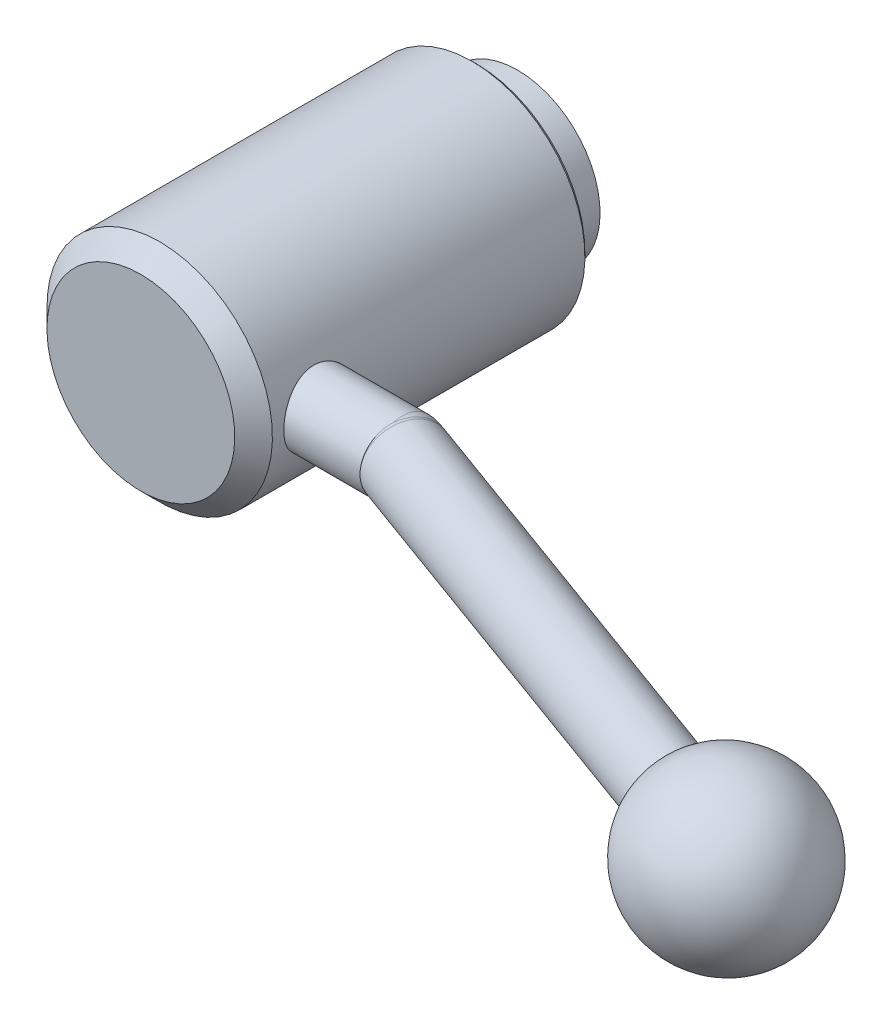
ISO-10303-21;
HEADER;
FILE_DESCRIPTION(('STEP AP214'),'2;1');
FILE_NAME('part.step','',(''),(''),'','','');
FILE_SCHEMA(('AUTOMOTIVE_DESIGN { 1 0 10303 214 1 1 1 1 }'));
ENDSEC;
DATA;
#1=APPLICATION_CONTEXT('core data for automotive mechanical design processes');
#2=APPLICATION_PROTOCOL_DEFINITION('international standard','automotive_design',2000,#1);
#3=PRODUCT_CONTEXT('',#1,'mechanical');
#4=PRODUCT('Part','Part','',(#3));
#5=PRODUCT_RELATED_PRODUCT_CATEGORY('part','',(#4));
#6=PRODUCT_DEFINITION_FORMATION('','',#4);
#7=PRODUCT_DEFINITION_CONTEXT('part definition',#1,'design');
#8=PRODUCT_DEFINITION('design','',#6,#7);
#9=PRODUCT_DEFINITION_SHAPE('','',#8);
#10=(LENGTH_UNIT() NAMED_UNIT(*) SI_UNIT(.MILLI.,.METRE.));
#11=(NAMED_UNIT(*) PLANE_ANGLE_UNIT() SI_UNIT($,.RADIAN.));
#12=(NAMED_UNIT(*) SI_UNIT($,.STERADIAN.) SOLID_ANGLE_UNIT());
#13=UNCERTAINTY_MEASURE_WITH_UNIT(LENGTH_MEASURE(1.E-05),#10,'distance_accuracy_value','');
#14=(GEOMETRIC_REPRESENTATION_CONTEXT(3) GLOBAL_UNCERTAINTY_ASSIGNED_CONTEXT((#13)) GLOBAL_UNIT_ASSIGNED_CONTEXT((#10,
#11,#12)) REPRESENTATION_CONTEXT('',''));
#15=CARTESIAN_POINT('',(0.,0.,0.));
#16=DIRECTION('',(0.,0.,1.));
#17=DIRECTION('',(1.,0.,0.));
#18=AXIS2_PLACEMENT_3D('',#15,#16,#17);
#19=CARTESIAN_POINT('',(0.,0.,0.));
#20=DIRECTION('',(0.,0.,-1.));
#21=DIRECTION('',(0.,1.,0.));
#22=AXIS2_PLACEMENT_3D('',#19,#20,#21);
#23=CYLINDRICAL_SURFACE('',#22,20.5);
#24=CARTESIAN_POINT('',(0.,0.,8.25));
#25=DIRECTION('',(0.,0.,-1.));
#26=DIRECTION('',(0.,1.,0.));
#27=AXIS2_PLACEMENT_3D('',#24,#25,#26);
#28=CIRCLE('',#27,20.5);
#29=CARTESIAN_POINT('',(0.,20.5,8.25));
#30=VERTEX_POINT('',#29);
#31=EDGE_CURVE('E145',#30,#30,#28,.T.);
#32=ORIENTED_EDGE('',*,*,#31,.F.);
#33=EDGE_LOOP('',(#32));
#34=FACE_BOUND('',#33,.T.);
#35=CARTESIAN_POINT('',(19.4422220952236,6.5,56.5));
#36=CARTESIAN_POINT('',(19.4422222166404,6.49999984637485,56.6775608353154));
#37=CARTESIAN_POINT('',(19.4446611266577,6.49271825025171,56.8551242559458));
#38=CARTESIAN_POINT('',(19.454338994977,6.46366201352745,57.2089295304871));
#39=CARTESIAN_POINT('',(19.4615780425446,6.44188710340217,57.3851713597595));
#40=CARTESIAN_POINT('',(19.4806268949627,6.38405046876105,57.7350468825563));
#41=CARTESIAN_POINT('',(19.4924368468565,6.34798828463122,57.9086804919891));
#42=CARTESIAN_POINT('',(19.5202654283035,6.26189122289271,58.2521641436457));
#43=CARTESIAN_POINT('',(19.5362855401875,6.2118514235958,58.4220128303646));
#44=CARTESIAN_POINT('',(19.5720112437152,6.09835258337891,58.7563693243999));
#45=CARTESIAN_POINT('',(19.5917092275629,6.03492120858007,58.9208873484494));
#46=CARTESIAN_POINT('',(19.6342385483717,5.89508386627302,59.2438952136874));
#47=CARTESIAN_POINT('',(19.6570700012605,5.8186774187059,59.4023848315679));
#48=CARTESIAN_POINT('',(19.7052295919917,5.65343532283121,59.7124029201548));
#49=CARTESIAN_POINT('',(19.7305584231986,5.5645962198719,59.8639294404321));
#50=CARTESIAN_POINT('',(19.7830095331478,5.37514542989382,60.159036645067));
#51=CARTESIAN_POINT('',(19.810131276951,5.27453724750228,60.3026196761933));
#52=CARTESIAN_POINT('',(19.8663573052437,5.05872294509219,60.5855845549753));
#53=CARTESIAN_POINT('',(19.8954973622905,4.94314912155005,60.7246789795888));
#54=CARTESIAN_POINT('',(19.9541229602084,4.70090397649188,60.9926738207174));
#55=CARTESIAN_POINT('',(19.9836083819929,4.57423638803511,61.1215776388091));
#56=CARTESIAN_POINT('',(20.0421539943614,4.31048905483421,61.3685042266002));
#57=CARTESIAN_POINT('',(20.071213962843,4.1734040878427,61.4865214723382));
#58=CARTESIAN_POINT('',(20.1281044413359,3.88977145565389,61.7107919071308));
#59=CARTESIAN_POINT('',(20.1559354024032,3.74322731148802,61.8170494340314));
#60=CARTESIAN_POINT('',(20.2102746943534,3.43793523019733,62.0195055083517));
#61=CARTESIAN_POINT('',(20.236735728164,3.2789797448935,62.1154041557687));
#62=CARTESIAN_POINT('',(20.2868421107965,2.95316588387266,62.2933802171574));
#63=CARTESIAN_POINT('',(20.3104885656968,2.786310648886,62.3754630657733));
#64=CARTESIAN_POINT('',(20.3543059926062,2.44575238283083,62.5251888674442));
#65=CARTESIAN_POINT('',(20.3744761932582,2.27204784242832,62.5928286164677));
#66=CARTESIAN_POINT('',(20.4107390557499,1.9191592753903,62.7130148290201));
#67=CARTESIAN_POINT('',(20.4268335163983,1.73997770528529,62.7655679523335));
#68=CARTESIAN_POINT('',(20.4540467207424,1.38310784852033,62.8537177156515));
#69=CARTESIAN_POINT('',(20.4653055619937,1.20554867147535,62.8897940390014));
#70=CARTESIAN_POINT('',(20.483240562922,0.847880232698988,62.9470057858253));
#71=CARTESIAN_POINT('',(20.489918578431,0.667772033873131,62.9681472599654));
#72=CARTESIAN_POINT('',(20.4985086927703,0.306306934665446,62.9953079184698));
#73=CARTESIAN_POINT('',(20.5004208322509,0.124950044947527,63.0013272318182));
#74=CARTESIAN_POINT('',(20.4994243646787,-0.237616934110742,62.9981845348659));
#75=CARTESIAN_POINT('',(20.4965158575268,-0.418827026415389,62.9890228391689));
#76=CARTESIAN_POINT('',(20.4861511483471,-0.773249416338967,62.9562077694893));
#77=CARTESIAN_POINT('',(20.4788613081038,-0.946515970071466,62.9330843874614));
#78=CARTESIAN_POINT('',(20.4600679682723,-1.29046183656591,62.8730051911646));
#79=CARTESIAN_POINT('',(20.4485630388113,-1.46114025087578,62.8360446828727));
#80=CARTESIAN_POINT('',(20.4216452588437,-1.798625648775,62.7486256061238));
#81=CARTESIAN_POINT('',(20.4062336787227,-1.9654338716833,62.6981714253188));
#82=CARTESIAN_POINT('',(20.3718916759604,-2.29420139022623,62.5841535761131));
#83=CARTESIAN_POINT('',(20.35295992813,-2.45615883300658,62.5205849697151));
#84=CARTESIAN_POINT('',(20.3118147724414,-2.77605889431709,62.3799991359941));
#85=CARTESIAN_POINT('',(20.2895645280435,-2.93392950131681,62.3028289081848));
#86=CARTESIAN_POINT('',(20.2425168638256,-3.24266972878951,62.1361230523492));
#87=CARTESIAN_POINT('',(20.2177185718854,-3.39353692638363,62.0465831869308));
#88=CARTESIAN_POINT('',(20.1662066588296,-3.68732340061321,61.8557751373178));
#89=CARTESIAN_POINT('',(20.1394929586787,-3.8302423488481,61.7545064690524));
#90=CARTESIAN_POINT('',(20.0848204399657,-4.10730208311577,61.5408997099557));
#91=CARTESIAN_POINT('',(20.0568615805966,-4.24144258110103,61.4285612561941));
#92=CARTESIAN_POINT('',(19.9991827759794,-4.50574800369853,61.1884400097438));
#93=CARTESIAN_POINT('',(19.9694388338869,-4.63549313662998,61.0602005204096));
#94=CARTESIAN_POINT('',(19.9101839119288,-4.88373422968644,60.7932909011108));
#95=CARTESIAN_POINT('',(19.8806728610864,-5.00223374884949,60.6546240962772));
#96=CARTESIAN_POINT('',(19.8226810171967,-5.22731613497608,60.3676143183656));
#97=CARTESIAN_POINT('',(19.7942007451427,-5.33389303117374,60.2192665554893));
#98=CARTESIAN_POINT('',(19.739110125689,-5.53428674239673,59.9139422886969));
#99=CARTESIAN_POINT('',(19.7124990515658,-5.62810852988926,59.7569691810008));
#100=CARTESIAN_POINT('',(19.6616069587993,-5.80341705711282,59.4333642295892));
#101=CARTESIAN_POINT('',(19.6373585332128,-5.88473833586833,59.2666375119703));
#102=CARTESIAN_POINT('',(19.5923338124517,-6.03294761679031,58.9265081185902));
#103=CARTESIAN_POINT('',(19.5715561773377,-6.09984119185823,58.7531080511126));
#104=CARTESIAN_POINT('',(19.5341361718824,-6.21863379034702,58.4008267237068));
#105=CARTESIAN_POINT('',(19.5174933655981,-6.2705343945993,58.2219460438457));
#106=CARTESIAN_POINT('',(19.4888985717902,-6.35885149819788,57.8600357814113));
#107=CARTESIAN_POINT('',(19.4769463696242,-6.39526870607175,57.6770063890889));
#108=CARTESIAN_POINT('',(19.4585313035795,-6.45107630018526,57.3158506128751));
#109=CARTESIAN_POINT('',(19.4518622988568,-6.47110721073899,57.1378335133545));
#110=CARTESIAN_POINT('',(19.443427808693,-6.49640633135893,56.7806394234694));
#111=CARTESIAN_POINT('',(19.4416621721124,-6.50167499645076,56.6014624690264));
#112=CARTESIAN_POINT('',(19.443091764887,-6.49739848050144,56.2433320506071));
#113=CARTESIAN_POINT('',(19.4462862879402,-6.48785540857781,56.0643785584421));
#114=CARTESIAN_POINT('',(19.4575309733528,-6.45405335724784,55.7080231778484));
#115=CARTESIAN_POINT('',(19.4655810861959,-6.4297945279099,55.5306212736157));
#116=CARTESIAN_POINT('',(19.4859636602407,-6.36775067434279,55.1840196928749));
#117=CARTESIAN_POINT('',(19.4981590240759,-6.33039761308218,55.0147343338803));
#118=CARTESIAN_POINT('',(19.5265148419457,-6.24238368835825,54.6799411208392));
#119=CARTESIAN_POINT('',(19.5426766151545,-6.19171839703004,54.5144345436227));
#120=CARTESIAN_POINT('',(19.5784935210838,-6.07751333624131,54.1883625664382));
#121=CARTESIAN_POINT('',(19.598147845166,-6.01397654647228,54.0277960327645));
#122=CARTESIAN_POINT('',(19.6404122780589,-5.87448001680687,53.7124890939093));
#123=CARTESIAN_POINT('',(19.663023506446,-5.79851556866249,53.5577509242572));
#124=CARTESIAN_POINT('',(19.711276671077,-5.63234141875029,53.2506795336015));
#125=CARTESIAN_POINT('',(19.7369874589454,-5.54178262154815,53.0985460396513));
#126=CARTESIAN_POINT('',(19.7901869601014,-5.34869406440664,52.8023330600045));
#127=CARTESIAN_POINT('',(19.8176762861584,-5.24616016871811,52.6582563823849));
#128=CARTESIAN_POINT('',(19.8736901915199,-5.02980339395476,52.3790447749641));
#129=CARTESIAN_POINT('',(19.9022148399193,-4.91597976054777,52.2439104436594));
#130=CARTESIAN_POINT('',(19.9595511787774,-4.67774787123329,51.9833824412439));
#131=CARTESIAN_POINT('',(19.9883628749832,-4.55333940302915,51.8579889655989));
#132=CARTESIAN_POINT('',(20.0467640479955,-4.28909489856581,51.612508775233));
#133=CARTESIAN_POINT('',(20.0763335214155,-4.14882502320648,51.4928837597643));
#134=CARTESIAN_POINT('',(20.1341446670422,-3.85851185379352,51.2658977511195));
#135=CARTESIAN_POINT('',(20.1623867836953,-3.70847187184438,51.1585326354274));
#136=CARTESIAN_POINT('',(20.2167791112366,-3.39947872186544,50.956751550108));
#137=CARTESIAN_POINT('',(20.2429285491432,-3.24052229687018,50.8623403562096));
#138=CARTESIAN_POINT('',(20.2923799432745,-2.91486277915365,50.6872782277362));
#139=CARTESIAN_POINT('',(20.31568308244,-2.74816294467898,50.606621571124));
#140=CARTESIAN_POINT('',(20.3586447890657,-2.40926409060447,50.4601915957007));
#141=CARTESIAN_POINT('',(20.3783271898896,-2.23711047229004,50.3943202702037));
#142=CARTESIAN_POINT('',(20.4136744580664,-1.88752303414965,50.2773627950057));
#143=CARTESIAN_POINT('',(20.4293409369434,-1.71009136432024,50.2262707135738));
#144=CARTESIAN_POINT('',(20.4562117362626,-1.35121271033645,50.1393152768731));
#145=CARTESIAN_POINT('',(20.4674163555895,-1.16976599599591,50.1034509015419));
#146=CARTESIAN_POINT('',(20.4850348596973,-0.804250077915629,50.0472977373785));
#147=CARTESIAN_POINT('',(20.4914489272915,-0.620180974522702,50.0270083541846));
#148=CARTESIAN_POINT('',(20.4991281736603,-0.258824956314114,50.0027406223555));
#149=CARTESIAN_POINT('',(20.5006028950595,-0.0815867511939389,49.9980984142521));
#150=CARTESIAN_POINT('',(20.4989516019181,0.272717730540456,50.0033067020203));
#151=CARTESIAN_POINT('',(20.4958240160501,0.449783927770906,50.0131621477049));
#152=CARTESIAN_POINT('',(20.4850529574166,0.802303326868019,50.0472753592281));
#153=CARTESIAN_POINT('',(20.477411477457,0.977757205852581,50.0715267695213));
#154=CARTESIAN_POINT('',(20.4578179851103,1.32593306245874,50.1342162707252));
#155=CARTESIAN_POINT('',(20.4458643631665,1.49865399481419,50.1726596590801));
#156=CARTESIAN_POINT('',(20.4181583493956,1.83775920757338,50.2627729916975));
#157=CARTESIAN_POINT('',(20.4024599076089,2.00419775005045,50.314255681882));
#158=CARTESIAN_POINT('',(20.3675799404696,2.33214296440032,50.430290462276));
#159=CARTESIAN_POINT('',(20.3483971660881,2.49364784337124,50.4948472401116));
#160=CARTESIAN_POINT('',(20.3070431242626,2.8106122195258,50.6365039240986));
#161=CARTESIAN_POINT('',(20.2848725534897,2.96607311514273,50.7136009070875));
#162=CARTESIAN_POINT('',(20.2380837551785,3.2701125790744,50.8798225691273));
#163=CARTESIAN_POINT('',(20.2134646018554,3.41868851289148,50.9689518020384));
#164=CARTESIAN_POINT('',(20.1615167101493,3.71299497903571,51.1618658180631));
#165=CARTESIAN_POINT('',(20.1341240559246,3.85845386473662,51.2660479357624));
#166=CARTESIAN_POINT('',(20.0780825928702,4.14019829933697,51.4859491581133));
#167=CARTESIAN_POINT('',(20.0494333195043,4.27648040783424,51.6016725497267));
#168=CARTESIAN_POINT('',(19.991639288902,4.5389891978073,51.8438784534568));
#169=CARTESIAN_POINT('',(19.9624945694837,4.66521664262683,51.9703601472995));
#170=CARTESIAN_POINT('',(19.9044649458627,4.90690637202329,52.2333644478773));
#171=CARTESIAN_POINT('',(19.8755801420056,5.0223646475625,52.3698907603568));
#172=CARTESIAN_POINT('',(19.8178815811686,5.24550327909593,52.6569714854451));
#173=CARTESIAN_POINT('',(19.7891042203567,5.35278119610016,52.8078463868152));
#174=CARTESIAN_POINT('',(19.7335121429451,5.55422553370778,53.118455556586));
#175=CARTESIAN_POINT('',(19.7066974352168,5.64839189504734,53.2781898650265));
#176=CARTESIAN_POINT('',(19.6558508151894,5.82286763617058,53.6054219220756));
#177=CARTESIAN_POINT('',(19.6318180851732,5.90318109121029,53.77291736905));
#178=CARTESIAN_POINT('',(19.5872824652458,6.04931454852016,54.1145638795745));
#179=CARTESIAN_POINT('',(19.5667793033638,6.11513566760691,54.2887144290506));
#180=CARTESIAN_POINT('',(19.5313806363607,6.22722680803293,54.6288485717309));
#181=CARTESIAN_POINT('',(19.5161756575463,6.27460911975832,54.7944341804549));
#182=CARTESIAN_POINT('',(19.4897776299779,6.35613148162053,55.1291406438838));
#183=CARTESIAN_POINT('',(19.4785842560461,6.39027260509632,55.2982612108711));
#184=CARTESIAN_POINT('',(19.4605385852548,6.44501906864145,55.6389039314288));
#185=CARTESIAN_POINT('',(19.4536861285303,6.46562490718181,55.8104259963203));
#186=CARTESIAN_POINT('',(19.4445285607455,6.49311322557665,56.1546314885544));
#187=CARTESIAN_POINT('',(19.4422219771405,6.50000014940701,56.3273145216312));
#188=CARTESIAN_POINT('',(19.4422220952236,6.5,56.5));
#189=B_SPLINE_CURVE_WITH_KNOTS('',3,(#35,#36,#37,#38,#39,#40,#41,#42,#43,#44,#45,#46,#47,#48,
#49,#50,#51,#52,#53,#54,#55,#56,#57,#58,#59,#60,#61,#62,#63,#64,#65,#66,#67,#68,#69,#70,#71,#72,
#73,#74,#75,#76,#77,#78,#79,#80,#81,#82,#83,#84,#85,#86,#87,#88,#89,#90,#91,#92,#93,#94,#95,#96,
#97,#98,#99,#100,#101,#102,#103,#104,#105,#106,#107,#108,#109,#110,#111,#112,#113,#114,#115,
#116,#117,#118,#119,#120,#121,#122,#123,#124,#125,#126,#127,#128,#129,#130,#131,#132,#133,#134,
#135,#136,#137,#138,#139,#140,#141,#142,#143,#144,#145,#146,#147,#148,#149,#150,#151,#152,#153,
#154,#155,#156,#157,#158,#159,#160,#161,#162,#163,#164,#165,#166,#167,#168,#169,#170,#171,#172,
#173,#174,#175,#176,#177,#178,#179,#180,#181,#182,#183,#184,#185,#186,#187,#188),.UNSPECIFIED.,
.T.,.F.,(4,2,2,2,2,2,2,2,2,2,2,2,2,2,2,2,2,2,2,2,2,2,2,2,2,2,2,2,2,2,2,2,2,2,2,2,2,2,2,2,2,2,2,
2,2,2,2,2,2,2,2,2,2,2,2,2,2,2,2,2,2,2,2,2,2,2,2,2,2,2,2,2,2,2,2,2,4),(0.,0.532521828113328,
1.06505355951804,1.5976024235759,2.13033904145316,2.66198564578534,3.19365192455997,
3.72546623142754,4.25712257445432,4.80602728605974,5.35474799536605,5.90374561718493,
6.45254004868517,7.0144069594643,7.5760523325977,8.13782217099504,8.6993436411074,
9.24327177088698,9.78697940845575,10.3306824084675,10.8743741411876,11.3986215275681,
11.9230469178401,12.4473019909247,12.9717548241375,13.5025350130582,14.0334974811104,
14.5644818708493,15.0954836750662,15.6493464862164,16.2030334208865,16.7569964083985,
17.3107428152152,17.8712831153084,18.4316065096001,18.991870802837,19.5521094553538,
20.0892329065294,20.6263398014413,21.163370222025,21.7003951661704,22.2211537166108,
22.7420856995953,23.2628972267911,23.7839065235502,24.3200181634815,24.8563155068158,
25.3926487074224,25.9289926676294,26.488454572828,27.0477277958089,27.6072066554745,
28.1664521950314,28.7218733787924,29.2770713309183,29.8322320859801,30.3873716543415,
30.9186402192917,31.4500902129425,31.9813057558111,32.512719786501,33.0368968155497,
33.5612621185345,34.0855053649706,34.6099475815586,35.1523480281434,35.6949507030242,
36.237512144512,36.7802747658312,37.3416479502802,37.9030236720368,38.4642339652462,
39.0254009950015,39.5435300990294,40.061617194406,40.579685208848,41.0975853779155),.UNSPECIFIED.);
#190=CARTESIAN_POINT('',(19.4422220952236,6.5,56.5));
#191=VERTEX_POINT('',#190);
#192=EDGE_CURVE('E22',#191,#191,#189,.T.);
#193=ORIENTED_EDGE('',*,*,#192,.F.);
#194=EDGE_LOOP('',(#193));
#195=FACE_BOUND('',#194,.T.);
#196=CARTESIAN_POINT('',(0.,0.,65.075));
#197=DIRECTION('',(0.,0.,-1.));
#198=DIRECTION('',(0.,1.,0.));
#199=AXIS2_PLACEMENT_3D('',#196,#197,#198);
#200=CIRCLE('',#199,20.5);
#201=CARTESIAN_POINT('',(0.,20.5,65.075));
#202=VERTEX_POINT('',#201);
#203=EDGE_CURVE('E147',#202,#202,#200,.T.);
#204=ORIENTED_EDGE('',*,*,#203,.T.);
#205=EDGE_LOOP('',(#204));
#206=FACE_BOUND('',#205,.T.);
#207=ADVANCED_FACE('F14',(#34,#195,#206),#23,.T.);
#208=CARTESIAN_POINT('',(0.,0.,68.5));
#209=DIRECTION('',(0.,0.,-1.));
#210=DIRECTION('',(0.,1.,0.));
#211=AXIS2_PLACEMENT_3D('',#208,#209,#210);
#212=PLANE('',#211);
#213=CARTESIAN_POINT('',(0.,0.,68.5));
#214=DIRECTION('',(0.,0.,-1.));
#215=DIRECTION('',(0.,1.,0.));
#216=AXIS2_PLACEMENT_3D('',#213,#214,#215);
#217=CIRCLE('',#216,17.075);
#218=CARTESIAN_POINT('',(0.,17.075,68.5));
#219=VERTEX_POINT('',#218);
#220=EDGE_CURVE('E78',#219,#219,#217,.T.);
#221=ORIENTED_EDGE('',*,*,#220,.F.);
#222=EDGE_LOOP('',(#221));
#223=FACE_BOUND('',#222,.T.);
#224=ADVANCED_FACE('F16',(#223),#212,.F.);
#225=CARTESIAN_POINT('',(0.,0.,68.5));
#226=DIRECTION('',(0.,0.,-1.));
#227=DIRECTION('',(0.,1.,0.));
#228=AXIS2_PLACEMENT_3D('',#225,#226,#227);
#229=CONICAL_SURFACE('',#228,17.075,0.785398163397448);
#230=ORIENTED_EDGE('',*,*,#203,.F.);
#231=EDGE_LOOP('',(#230));
#232=FACE_BOUND('',#231,.T.);
#233=ORIENTED_EDGE('',*,*,#220,.T.);
#234=EDGE_LOOP('',(#233));
#235=FACE_BOUND('',#234,.T.);
#236=ADVANCED_FACE('F64',(#232,#235),#229,.T.);
#237=CARTESIAN_POINT('',(0.,0.,8.25));
#238=DIRECTION('',(0.,0.,1.));
#239=DIRECTION('',(0.,-1.,0.));
#240=AXIS2_PLACEMENT_3D('',#237,#238,#239);
#241=CONICAL_SURFACE('',#240,20.5,0.785398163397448);
#242=CARTESIAN_POINT('',(0.,0.,7.5));
#243=DIRECTION('',(0.,0.,-1.));
#244=DIRECTION('',(0.,1.,0.));
#245=AXIS2_PLACEMENT_3D('',#242,#243,#244);
#246=CIRCLE('',#245,19.75);
#247=CARTESIAN_POINT('',(0.,19.75,7.5));
#248=VERTEX_POINT('',#247);
#249=EDGE_CURVE('E140',#248,#248,#246,.T.);
#250=ORIENTED_EDGE('',*,*,#249,.F.);
#251=EDGE_LOOP('',(#250));
#252=FACE_BOUND('',#251,.T.);
#253=ORIENTED_EDGE('',*,*,#31,.T.);
#254=EDGE_LOOP('',(#253));
#255=FACE_BOUND('',#254,.T.);
#256=ADVANCED_FACE('F70',(#252,#255),#241,.T.);
#257=CARTESIAN_POINT('',(19.75,0.,7.5));
#258=DIRECTION('',(0.,0.,1.));
#259=DIRECTION('',(0.,-1.,0.));
#260=AXIS2_PLACEMENT_3D('',#257,#258,#259);
#261=PLANE('',#260);
#262=CARTESIAN_POINT('',(0.,0.,7.5));
#263=DIRECTION('',(0.,0.,-1.));
#264=DIRECTION('',(0.,1.,0.));
#265=AXIS2_PLACEMENT_3D('',#262,#263,#264);
#266=CIRCLE('',#265,15.);
#267=CARTESIAN_POINT('',(0.,15.,7.5));
#268=VERTEX_POINT('',#267);
#269=EDGE_CURVE('E138',#268,#268,#266,.T.);
#270=ORIENTED_EDGE('',*,*,#269,.F.);
#271=EDGE_LOOP('',(#270));
#272=FACE_BOUND('',#271,.T.);
#273=ORIENTED_EDGE('',*,*,#249,.T.);
#274=EDGE_LOOP('',(#273));
#275=FACE_BOUND('',#274,.T.);
#276=ADVANCED_FACE('F159',(#272,#275),#261,.F.);
#277=CARTESIAN_POINT('',(0.,0.,0.));
#278=DIRECTION('',(0.,0.,-1.));
#279=DIRECTION('',(0.,1.,0.));
#280=AXIS2_PLACEMENT_3D('',#277,#278,#279);
#281=CYLINDRICAL_SURFACE('',#280,15.);
#282=CARTESIAN_POINT('',(0.,0.,0.));
#283=DIRECTION('',(0.,0.,-1.));
#284=DIRECTION('',(0.,1.,0.));
#285=AXIS2_PLACEMENT_3D('',#282,#283,#284);
#286=CIRCLE('',#285,15.);
#287=CARTESIAN_POINT('',(0.,15.,0.));
#288=VERTEX_POINT('',#287);
#289=EDGE_CURVE('E136',#288,#288,#286,.T.);
#290=ORIENTED_EDGE('',*,*,#289,.F.);
#291=EDGE_LOOP('',(#290));
#292=FACE_BOUND('',#291,.T.);
#293=ORIENTED_EDGE('',*,*,#269,.T.);
#294=EDGE_LOOP('',(#293));
#295=FACE_BOUND('',#294,.T.);
#296=ADVANCED_FACE('F133',(#292,#295),#281,.T.);
#297=CARTESIAN_POINT('',(15.,0.,0.));
#298=DIRECTION('',(0.,0.,1.));
#299=DIRECTION('',(0.,-1.,0.));
#300=AXIS2_PLACEMENT_3D('',#297,#298,#299);
#301=PLANE('',#300);
#302=CARTESIAN_POINT('',(0.,0.,0.));
#303=DIRECTION('',(0.,0.,-1.));
#304=DIRECTION('',(0.,1.,0.));
#305=AXIS2_PLACEMENT_3D('',#302,#303,#304);
#306=CIRCLE('',#305,10.);
#307=CARTESIAN_POINT('',(0.,10.,0.));
#308=VERTEX_POINT('',#307);
#309=EDGE_CURVE('E122',#308,#308,#306,.T.);
#310=ORIENTED_EDGE('',*,*,#309,.F.);
#311=EDGE_LOOP('',(#310));
#312=FACE_BOUND('',#311,.T.);
#313=ORIENTED_EDGE('',*,*,#289,.T.);
#314=EDGE_LOOP('',(#313));
#315=FACE_BOUND('',#314,.T.);
#316=ADVANCED_FACE('F86',(#312,#315),#301,.F.);
#317=CARTESIAN_POINT('',(42.,0.,56.5));
#318=DIRECTION('',(1.,0.,0.));
#319=DIRECTION('',(0.,1.,0.));
#320=AXIS2_PLACEMENT_3D('',#317,#318,#319);
#321=CYLINDRICAL_SURFACE('',#320,6.5);
#322=CARTESIAN_POINT('',(35.5002,-6.28048269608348,58.1749737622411));
#323=CARTESIAN_POINT('',(35.4701911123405,-6.2584855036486,58.2574684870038));
#324=CARTESIAN_POINT('',(35.4414052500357,-6.23475002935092,58.3399237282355));
#325=CARTESIAN_POINT('',(35.3859523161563,-6.18381246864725,58.5044625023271));
#326=CARTESIAN_POINT('',(35.3592849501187,-6.15661086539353,58.5865460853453));
#327=CARTESIAN_POINT('',(35.2819864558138,-6.06984393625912,58.8317442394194));
#328=CARTESIAN_POINT('',(35.2340264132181,-6.00509209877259,58.9938982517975));
#329=CARTESIAN_POINT('',(35.1437652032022,-5.8621289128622,59.3135555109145));
#330=CARTESIAN_POINT('',(35.1014588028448,-5.78393016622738,59.471062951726));
#331=CARTESIAN_POINT('',(35.0215196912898,-5.61443273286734,59.7801227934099));
#332=CARTESIAN_POINT('',(34.9838873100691,-5.5231331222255,59.9316747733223));
#333=CARTESIAN_POINT('',(34.9127228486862,-5.32805112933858,60.2273614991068));
#334=CARTESIAN_POINT('',(34.8791877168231,-5.22427815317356,60.371501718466));
#335=CARTESIAN_POINT('',(34.8157745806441,-5.00483968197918,60.6512875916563));
#336=CARTESIAN_POINT('',(34.7858966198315,-4.88917404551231,60.7869331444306));
#337=CARTESIAN_POINT('',(34.7295154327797,-4.64671898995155,61.048605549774));
#338=CARTESIAN_POINT('',(34.7030116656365,-4.51993135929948,61.1746339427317));
#339=CARTESIAN_POINT('',(34.6531671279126,-4.25605741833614,61.4160918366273));
#340=CARTESIAN_POINT('',(34.6298263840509,-4.11897102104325,61.5315212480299));
#341=CARTESIAN_POINT('',(34.5859306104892,-3.83395076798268,61.7520111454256));
#342=CARTESIAN_POINT('',(34.5654071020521,-3.68591886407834,61.8569512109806));
#343=CARTESIAN_POINT('',(34.5273160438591,-3.38127311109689,62.0542722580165));
#344=CARTESIAN_POINT('',(34.5097495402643,-3.22465625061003,62.1466487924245));
#345=CARTESIAN_POINT('',(34.4775004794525,-2.90402878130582,62.3180456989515));
#346=CARTESIAN_POINT('',(34.4628174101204,-2.74001949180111,62.3970684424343));
#347=CARTESIAN_POINT('',(34.4362651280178,-2.4056942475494,62.5411738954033));
#348=CARTESIAN_POINT('',(34.424396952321,-2.23537599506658,62.606251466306));
#349=CARTESIAN_POINT('',(34.4035252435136,-1.89117431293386,62.7214241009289));
#350=CARTESIAN_POINT('',(34.3944984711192,-1.71733288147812,62.7716404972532));
#351=CARTESIAN_POINT('',(34.3791416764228,-1.36588965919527,62.8574425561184));
#352=CARTESIAN_POINT('',(34.3728126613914,-1.18828648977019,62.8930227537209));
#353=CARTESIAN_POINT('',(34.3628391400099,-0.830755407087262,62.9492305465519));
#354=CARTESIAN_POINT('',(34.3591931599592,-0.650828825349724,62.9698663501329));
#355=CARTESIAN_POINT('',(34.3545680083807,-0.289765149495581,62.996061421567));
#356=CARTESIAN_POINT('',(34.3535900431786,-0.108627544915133,63.0016138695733));
#357=CARTESIAN_POINT('',(34.3542996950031,0.252555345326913,62.9975893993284));
#358=CARTESIAN_POINT('',(34.355973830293,0.43260151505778,62.9880890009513));
#359=CARTESIAN_POINT('',(34.361966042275,0.791157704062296,62.9541833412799));
#360=CARTESIAN_POINT('',(34.3662829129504,0.969668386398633,62.9297848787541));
#361=CARTESIAN_POINT('',(34.377575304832,1.32405576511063,62.8662625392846));
#362=CARTESIAN_POINT('',(34.3845521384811,1.49993111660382,62.8271313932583));
#363=CARTESIAN_POINT('',(34.4011832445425,1.847645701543,62.7344660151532));
#364=CARTESIAN_POINT('',(34.4108365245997,2.01948640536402,62.6809371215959));
#365=CARTESIAN_POINT('',(34.4328583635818,2.35804742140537,62.5598634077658));
#366=CARTESIAN_POINT('',(34.4452278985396,2.52476586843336,62.4923135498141));
#367=CARTESIAN_POINT('',(34.472721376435,2.85178734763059,62.3437616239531));
#368=CARTESIAN_POINT('',(34.4878443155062,3.01209269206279,62.2627644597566));
#369=CARTESIAN_POINT('',(34.5209144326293,3.32526997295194,62.0879110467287));
#370=CARTESIAN_POINT('',(34.538862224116,3.47814028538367,61.9940520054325));
#371=CARTESIAN_POINT('',(34.5776589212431,3.77530504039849,61.7942532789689));
#372=CARTESIAN_POINT('',(34.5985068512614,3.9196023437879,61.6883176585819));
#373=CARTESIAN_POINT('',(34.6433408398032,4.199419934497,61.4645872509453));
#374=CARTESIAN_POINT('',(34.6673426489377,4.33489069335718,61.3467336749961));
#375=CARTESIAN_POINT('',(34.7185603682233,4.59531298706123,61.1005655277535));
#376=CARTESIAN_POINT('',(34.7457763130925,4.72026440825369,60.9722508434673));
#377=CARTESIAN_POINT('',(34.8036465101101,4.95882988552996,60.70617837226));
#378=CARTESIAN_POINT('',(34.8343011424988,5.07244268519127,60.5684195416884));
#379=CARTESIAN_POINT('',(34.8993555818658,5.28757920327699,60.2846019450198));
#380=CARTESIAN_POINT('',(34.9337552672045,5.38910331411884,60.1385434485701));
#381=CARTESIAN_POINT('',(35.0048466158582,5.57448375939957,59.8471450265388));
#382=CARTESIAN_POINT('',(35.0413260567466,5.65898432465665,59.7021627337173));
#383=CARTESIAN_POINT('',(35.1186048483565,5.81610839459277,59.4070309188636));
#384=CARTESIAN_POINT('',(35.1594036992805,5.88873327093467,59.2568819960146));
#385=CARTESIAN_POINT('',(35.2461889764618,6.02181290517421,58.9526179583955));
#386=CARTESIAN_POINT('',(35.2921778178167,6.08226196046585,58.798501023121));
#387=CARTESIAN_POINT('',(35.3660624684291,6.16360062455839,58.5656236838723));
#388=CARTESIAN_POINT('',(35.3915152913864,6.18916346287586,58.4876924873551));
#389=CARTESIAN_POINT('',(35.4443438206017,6.23716716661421,58.3315099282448));
#390=CARTESIAN_POINT('',(35.4717197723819,6.25960763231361,58.2532585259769));
#391=CARTESIAN_POINT('',(35.5001999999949,6.28048269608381,58.17497376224));
#392=B_SPLINE_CURVE_WITH_KNOTS('',3,(#322,#323,#324,#325,#326,#327,#328,#329,#330,#331,#332,
#333,#334,#335,#336,#337,#338,#339,#340,#341,#342,#343,#344,#345,#346,#347,#348,#349,#350,#351,
#352,#353,#354,#355,#356,#357,#358,#359,#360,#361,#362,#363,#364,#365,#366,#367,#368,#369,#370,
#371,#372,#373,#374,#375,#376,#377,#378,#379,#380,#381,#382,#383,#384,#385,#386,#387,#388,#389,
#390,#391),.UNSPECIFIED.,.F.,.F.,(4,2,2,2,2,2,2,2,2,2,2,2,2,2,2,2,2,2,2,2,2,2,2,2,2,2,2,2,2,2,2,
2,2,2,4),(0.,0.271433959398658,0.542830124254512,1.08532167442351,1.62730757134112,
2.16933170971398,2.71094964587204,3.25257402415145,3.79411146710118,4.33565348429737,
4.88283172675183,5.43020315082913,5.97747727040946,6.52495270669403,7.06782653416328,
7.61090287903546,8.15368070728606,8.6967039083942,9.2369755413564,9.77700080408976,
10.3172928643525,10.8573848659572,11.3976712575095,11.9377610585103,12.4779683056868,
13.0179942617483,13.5608276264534,14.1036668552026,14.6465661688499,15.189447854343,
15.7040975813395,16.2186878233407,16.7335185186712,16.99107618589,17.2486667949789),.UNSPECIFIED.);
#393=CARTESIAN_POINT('',(35.5,-6.28033613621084,58.1755232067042));
#394=VERTEX_POINT('',#393);
#395=CARTESIAN_POINT('',(34.3538746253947,0.,63.));
#396=VERTEX_POINT('',#395);
#397=EDGE_CURVE('E29',#394,#396,#392,.T.);
#398=ORIENTED_EDGE('',*,*,#397,.T.);
#399=CARTESIAN_POINT('',(35.5,6.28033613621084,58.1755232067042));
#400=VERTEX_POINT('',#399);
#401=EDGE_CURVE('E91',#396,#400,#392,.T.);
#402=ORIENTED_EDGE('',*,*,#401,.T.);
#403=CARTESIAN_POINT('',(35.5,0.,56.5));
#404=DIRECTION('',(1.,0.,0.));
#405=DIRECTION('',(0.,1.,0.));
#406=AXIS2_PLACEMENT_3D('',#403,#404,#405);
#407=CIRCLE('',#406,6.5);
#408=EDGE_CURVE('E100',#394,#400,#407,.T.);
#409=ORIENTED_EDGE('',*,*,#408,.F.);
#410=EDGE_LOOP('',(#398,#402,#409));
#411=FACE_BOUND('',#410,.T.);
#412=ORIENTED_EDGE('',*,*,#192,.T.);
#413=EDGE_LOOP('',(#412));
#414=FACE_BOUND('',#413,.T.);
#415=ADVANCED_FACE('F80',(#411,#414),#321,.T.);
#416=CARTESIAN_POINT('',(35.5,0.,56.5));
#417=DIRECTION('',(1.,0.,0.));
#418=DIRECTION('',(0.,0.,-1.));
#419=AXIS2_PLACEMENT_3D('',#416,#417,#418);
#420=SPHERICAL_SURFACE('',#419,6.5);
#421=CARTESIAN_POINT('',(36.0385027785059,0.,56.6959989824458));
#422=DIRECTION('',(0.93969262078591,0.,0.342020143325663));
#423=DIRECTION('',(-0.342020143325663,0.,0.939692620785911));
#424=AXIS2_PLACEMENT_3D('',#421,#422,#423);
#425=CIRCLE('',#424,6.4746891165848);
#426=EDGE_CURVE('E9',#394,#400,#425,.T.);
#427=ORIENTED_EDGE('',*,*,#426,.F.);
#428=ORIENTED_EDGE('',*,*,#408,.T.);
#429=EDGE_LOOP('',(#427,#428));
#430=FACE_BOUND('',#429,.T.);
#431=ADVANCED_FACE('F85',(#430),#420,.T.);
#432=CARTESIAN_POINT('',(36.5770055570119,0.,56.8919979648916));
#433=DIRECTION('',(0.939692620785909,0.,0.342020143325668));
#434=DIRECTION('',(-0.342020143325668,0.,0.939692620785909));
#435=AXIS2_PLACEMENT_3D('',#432,#433,#434);
#436=SPHERICAL_SURFACE('',#435,6.5);
#437=ORIENTED_EDGE('',*,*,#397,.F.);
#438=ORIENTED_EDGE('',*,*,#426,.T.);
#439=ORIENTED_EDGE('',*,*,#401,.F.);
#440=CARTESIAN_POINT('',(36.5770055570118,0.,56.8919979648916));
#441=DIRECTION('',(0.939692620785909,0.,0.342020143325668));
#442=DIRECTION('',(-0.342020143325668,0.,0.939692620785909));
#443=AXIS2_PLACEMENT_3D('',#440,#441,#442);
#444=CIRCLE('',#443,6.5);
#445=EDGE_CURVE('E98',#396,#396,#444,.T.);
#446=ORIENTED_EDGE('',*,*,#445,.F.);
#447=EDGE_LOOP('',(#437,#438,#439,#446));
#448=FACE_BOUND('',#447,.T.);
#449=ADVANCED_FACE('F102',(#448),#436,.T.);
#450=CARTESIAN_POINT('',(143.243431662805,0.,95.7154020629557));
#451=DIRECTION('',(0.939692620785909,0.,0.342020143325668));
#452=DIRECTION('',(-0.342020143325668,0.,0.939692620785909));
#453=AXIS2_PLACEMENT_3D('',#450,#451,#452);
#454=CYLINDRICAL_SURFACE('',#453,6.5);
#455=CARTESIAN_POINT('',(116.198996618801,0.,85.8720327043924));
#456=DIRECTION('',(0.939692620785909,0.,0.342020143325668));
#457=DIRECTION('',(-0.342020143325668,0.,0.939692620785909));
#458=AXIS2_PLACEMENT_3D('',#455,#456,#457);
#459=CIRCLE('',#458,6.5);
#460=CARTESIAN_POINT('',(113.975865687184,0.,91.9800347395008));
#461=VERTEX_POINT('',#460);
#462=EDGE_CURVE('E114',#461,#461,#459,.T.);
#463=ORIENTED_EDGE('',*,*,#462,.F.);
#464=EDGE_LOOP('',(#463));
#465=FACE_BOUND('',#464,.T.);
#466=ORIENTED_EDGE('',*,*,#445,.T.);
#467=EDGE_LOOP('',(#466));
#468=FACE_BOUND('',#467,.T.);
#469=ADVANCED_FACE('F54',(#465,#468),#454,.T.);
#470=CARTESIAN_POINT('',(113.975865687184,0.,91.9800347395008));
#471=DIRECTION('',(0.939692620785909,0.,0.342020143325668));
#472=DIRECTION('',(-0.342020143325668,0.,0.939692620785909));
#473=AXIS2_PLACEMENT_3D('',#470,#471,#472);
#474=PLANE('',#473);
#475=CARTESIAN_POINT('',(116.198996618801,0.,85.8720327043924));
#476=DIRECTION('',(0.939692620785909,0.,0.342020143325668));
#477=DIRECTION('',(-0.342020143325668,0.,0.939692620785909));
#478=AXIS2_PLACEMENT_3D('',#475,#476,#477);
#479=CIRCLE('',#478,8.80198315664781);
#480=CARTESIAN_POINT('',(113.188541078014,0.,94.1431913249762));
#481=VERTEX_POINT('',#480);
#482=EDGE_CURVE('E117',#481,#481,#479,.T.);
#483=ORIENTED_EDGE('',*,*,#482,.F.);
#484=EDGE_LOOP('',(#483));
#485=FACE_BOUND('',#484,.T.);
#486=ORIENTED_EDGE('',*,*,#462,.T.);
#487=EDGE_LOOP('',(#486));
#488=FACE_BOUND('',#487,.T.);
#489=ADVANCED_FACE('F43',(#485,#488),#474,.F.);
#490=CARTESIAN_POINT('',(128.5,0.,89.5));
#491=DIRECTION('',(0.,1.,0.));
#492=DIRECTION('',(-0.342020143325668,0.,0.939692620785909));
#493=AXIS2_PLACEMENT_3D('',#490,#491,#492);
#494=CIRCLE('',#493,16.);
#495=TRIMMED_CURVE('',#494,(PARAMETER_VALUE(-1.52089957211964)),
(PARAMETER_VALUE(1.52089957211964)),.T.,.PARAMETER.);
#496=CARTESIAN_POINT('',(128.22706216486,0.,90.2498905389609));
#497=DIRECTION('',(0.939692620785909,0.,0.342020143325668));
#498=AXIS1_PLACEMENT('',#496,#497);
#499=SURFACE_OF_REVOLUTION('',#495,#498);
#500=ORIENTED_EDGE('',*,*,#482,.T.);
#501=EDGE_LOOP('',(#500));
#502=FACE_BOUND('',#501,.T.);
#503=CARTESIAN_POINT('',(143.243431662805,0.,95.7154020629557));
#504=VERTEX_POINT('',#503);
#505=VERTEX_LOOP('',#504);
#506=FACE_BOUND('',#505,.T.);
#507=ADVANCED_FACE('F40',(#502,#506),#499,.T.);
#508=CARTESIAN_POINT('',(0.,0.,27.));
#509=DIRECTION('',(0.,0.,-1.));
#510=DIRECTION('',(0.,1.,0.));
#511=AXIS2_PLACEMENT_3D('',#508,#509,#510);
#512=CYLINDRICAL_SURFACE('',#511,10.);
#513=CARTESIAN_POINT('',(0.,0.,27.));
#514=DIRECTION('',(0.,0.,-1.));
#515=DIRECTION('',(0.,1.,0.));
#516=AXIS2_PLACEMENT_3D('',#513,#514,#515);
#517=CIRCLE('',#516,10.);
#518=CARTESIAN_POINT('',(0.,10.,27.));
#519=VERTEX_POINT('',#518);
#520=EDGE_CURVE('E119',#519,#519,#517,.T.);
#521=ORIENTED_EDGE('',*,*,#520,.F.);
#522=EDGE_LOOP('',(#521));
#523=FACE_BOUND('',#522,.T.);
#524=ORIENTED_EDGE('',*,*,#309,.T.);
#525=EDGE_LOOP('',(#524));
#526=FACE_BOUND('',#525,.T.);
#527=ADVANCED_FACE('F42',(#523,#526),#512,.F.);
#528=CARTESIAN_POINT('',(0.,0.,27.));
#529=DIRECTION('',(0.,0.,-1.));
#530=DIRECTION('',(0.,1.,0.));
#531=AXIS2_PLACEMENT_3D('',#528,#529,#530);
#532=PLANE('',#531);
#533=ORIENTED_EDGE('',*,*,#520,.T.);
#534=EDGE_LOOP('',(#533));
#535=FACE_BOUND('',#534,.T.);
#536=ADVANCED_FACE('F51',(#535),#532,.T.);
#537=CLOSED_SHELL('',(#207,#224,#236,#256,#276,#296,#316,#415,#431,#449,#469,#489,#507,#527,#536));
#538=MANIFOLD_SOLID_BREP('B1',#537);
#539=ADVANCED_BREP_SHAPE_REPRESENTATION('',(#18,#538),#14);
#540=SHAPE_DEFINITION_REPRESENTATION(#9,#539);
ENDSEC;
END-ISO-10303-21;
